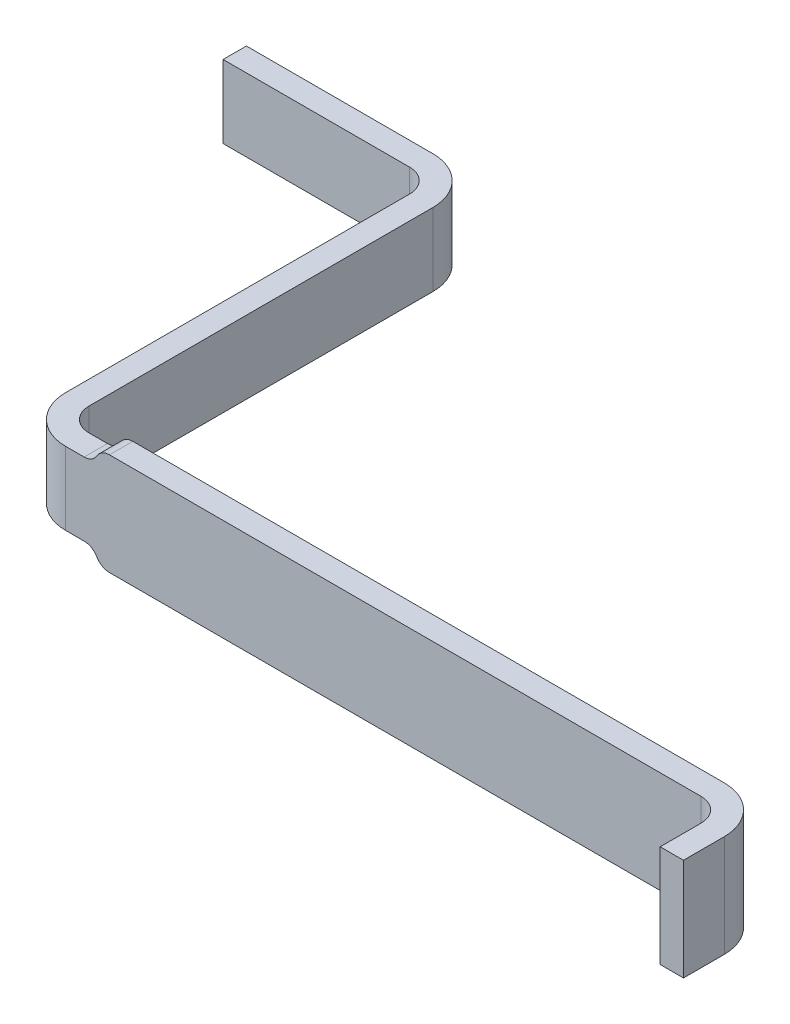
ISO-10303-21;
HEADER;
FILE_DESCRIPTION(('STEP AP214'),'2;1');
FILE_NAME('part.step','',(''),(''),'','','');
FILE_SCHEMA(('AUTOMOTIVE_DESIGN { 1 0 10303 214 1 1 1 1 }'));
ENDSEC;
DATA;
#1=APPLICATION_CONTEXT('core data for automotive mechanical design processes');
#2=APPLICATION_PROTOCOL_DEFINITION('international standard','automotive_design',2000,#1);
#3=PRODUCT_CONTEXT('',#1,'mechanical');
#4=PRODUCT('Part','Part','',(#3));
#5=PRODUCT_RELATED_PRODUCT_CATEGORY('part','',(#4));
#6=PRODUCT_DEFINITION_FORMATION('','',#4);
#7=PRODUCT_DEFINITION_CONTEXT('part definition',#1,'design');
#8=PRODUCT_DEFINITION('design','',#6,#7);
#9=PRODUCT_DEFINITION_SHAPE('','',#8);
#10=(LENGTH_UNIT() NAMED_UNIT(*) SI_UNIT(.MILLI.,.METRE.));
#11=(NAMED_UNIT(*) PLANE_ANGLE_UNIT() SI_UNIT($,.RADIAN.));
#12=(NAMED_UNIT(*) SI_UNIT($,.STERADIAN.) SOLID_ANGLE_UNIT());
#13=UNCERTAINTY_MEASURE_WITH_UNIT(LENGTH_MEASURE(1.E-05),#10,'distance_accuracy_value','');
#14=(GEOMETRIC_REPRESENTATION_CONTEXT(3) GLOBAL_UNCERTAINTY_ASSIGNED_CONTEXT((#13)) GLOBAL_UNIT_ASSIGNED_CONTEXT((#10,
#11,#12)) REPRESENTATION_CONTEXT('',''));
#15=CARTESIAN_POINT('',(0.,0.,0.));
#16=DIRECTION('',(0.,0.,1.));
#17=DIRECTION('',(1.,0.,0.));
#18=AXIS2_PLACEMENT_3D('',#15,#16,#17);
#19=CARTESIAN_POINT('',(1.31672563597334,0.,-0.0499999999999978));
#20=DIRECTION('',(0.,0.,-1.));
#21=DIRECTION('',(-1.,0.,0.));
#22=AXIS2_PLACEMENT_3D('',#19,#20,#21);
#23=PLANE('',#22);
#24=DIRECTION('',(0.,1.,0.));
#25=VECTOR('',#24,1.);
#26=CARTESIAN_POINT('',(-1.92,-0.175,-0.0500000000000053));
#27=LINE('',#26,#25);
#28=CARTESIAN_POINT('',(-1.92,-0.124999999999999,-0.0500000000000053));
#29=VERTEX_POINT('',#28);
#30=CARTESIAN_POINT('',(-1.92,0.125,-0.0500000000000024));
#31=VERTEX_POINT('',#30);
#32=EDGE_CURVE('E271',#29,#31,#27,.T.);
#33=ORIENTED_EDGE('',*,*,#32,.F.);
#34=DIRECTION('',(-1.,0.,0.));
#35=VECTOR('',#34,1.);
#36=CARTESIAN_POINT('',(-1.92,-0.124999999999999,-0.0500000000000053));
#37=LINE('',#36,#35);
#38=CARTESIAN_POINT('',(-1.28,-0.124999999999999,-0.0500000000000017));
#39=VERTEX_POINT('',#38);
#40=EDGE_CURVE('E127',#29,#39,#37,.F.);
#41=ORIENTED_EDGE('',*,*,#40,.T.);
#42=DIRECTION('',(0.,1.,0.));
#43=VECTOR('',#42,1.);
#44=CARTESIAN_POINT('',(-1.28,0.,-0.049999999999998));
#45=LINE('',#44,#43);
#46=CARTESIAN_POINT('',(-1.28,0.125,-0.0499999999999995));
#47=VERTEX_POINT('',#46);
#48=EDGE_CURVE('E263',#39,#47,#45,.T.);
#49=ORIENTED_EDGE('',*,*,#48,.T.);
#50=DIRECTION('',(1.,0.,0.));
#51=VECTOR('',#50,1.);
#52=CARTESIAN_POINT('',(0.290123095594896,0.124999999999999,-0.0500000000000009));
#53=LINE('',#52,#51);
#54=EDGE_CURVE('E261',#47,#31,#53,.F.);
#55=ORIENTED_EDGE('',*,*,#54,.T.);
#56=EDGE_LOOP('',(#33,#41,#49,#55));
#57=FACE_BOUND('',#56,.T.);
#58=ADVANCED_FACE('F16',(#57),#23,.F.);
#59=CARTESIAN_POINT('',(-1.92,-0.175,-0.0500000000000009));
#60=DIRECTION('',(-1.,0.,0.));
#61=DIRECTION('',(0.,0.,1.));
#62=AXIS2_PLACEMENT_3D('',#59,#60,#61);
#63=PLANE('',#62);
#64=DIRECTION('',(0.,0.,1.));
#65=VECTOR('',#64,1.);
#66=CARTESIAN_POINT('',(-1.92,-0.124999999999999,-0.0500000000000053));
#67=LINE('',#66,#65);
#68=CARTESIAN_POINT('',(-1.92,-0.124999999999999,-0.130000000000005));
#69=VERTEX_POINT('',#68);
#70=EDGE_CURVE('E133',#69,#29,#67,.T.);
#71=ORIENTED_EDGE('',*,*,#70,.T.);
#72=ORIENTED_EDGE('',*,*,#32,.T.);
#73=DIRECTION('',(0.,0.,1.));
#74=VECTOR('',#73,1.);
#75=CARTESIAN_POINT('',(-1.92,0.125,-0.05));
#76=LINE('',#75,#74);
#77=CARTESIAN_POINT('',(-1.92,0.125,-0.130000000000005));
#78=VERTEX_POINT('',#77);
#79=EDGE_CURVE('E256',#31,#78,#76,.F.);
#80=ORIENTED_EDGE('',*,*,#79,.T.);
#81=DIRECTION('',(0.,1.,0.));
#82=VECTOR('',#81,1.);
#83=CARTESIAN_POINT('',(-1.92,0.,-0.130000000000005));
#84=LINE('',#83,#82);
#85=EDGE_CURVE('E240',#69,#78,#84,.T.);
#86=ORIENTED_EDGE('',*,*,#85,.F.);
#87=EDGE_LOOP('',(#71,#72,#80,#86));
#88=FACE_BOUND('',#87,.T.);
#89=ADVANCED_FACE('F433',(#88),#63,.T.);
#90=CARTESIAN_POINT('',(-1.28,0.,0.0299999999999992));
#91=DIRECTION('',(0.,1.,0.));
#92=DIRECTION('',(0.,0.,1.));
#93=AXIS2_PLACEMENT_3D('',#90,#91,#92);
#94=CYLINDRICAL_SURFACE('',#93,0.0799999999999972);
#95=ORIENTED_EDGE('',*,*,#48,.F.);
#96=CARTESIAN_POINT('',(-1.28,-0.124999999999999,0.0299999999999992));
#97=DIRECTION('',(0.,1.,0.));
#98=DIRECTION('',(0.,0.,1.));
#99=AXIS2_PLACEMENT_3D('',#96,#97,#98);
#100=CIRCLE('',#99,0.0799999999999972);
#101=CARTESIAN_POINT('',(-1.2,-0.124999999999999,0.0299999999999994));
#102=VERTEX_POINT('',#101);
#103=EDGE_CURVE('E19',#39,#102,#100,.F.);
#104=ORIENTED_EDGE('',*,*,#103,.T.);
#105=DIRECTION('',(0.,1.,0.));
#106=VECTOR('',#105,1.);
#107=CARTESIAN_POINT('',(-1.2,0.,0.0299999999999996));
#108=LINE('',#107,#106);
#109=CARTESIAN_POINT('',(-1.2,0.125,0.0299999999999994));
#110=VERTEX_POINT('',#109);
#111=EDGE_CURVE('E229',#102,#110,#108,.T.);
#112=ORIENTED_EDGE('',*,*,#111,.T.);
#113=CARTESIAN_POINT('',(-1.28,0.125,0.0299999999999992));
#114=DIRECTION('',(0.,1.,0.));
#115=DIRECTION('',(0.,0.,1.));
#116=AXIS2_PLACEMENT_3D('',#113,#114,#115);
#117=CIRCLE('',#116,0.0799999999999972);
#118=EDGE_CURVE('E226',#110,#47,#117,.T.);
#119=ORIENTED_EDGE('',*,*,#118,.T.);
#120=EDGE_LOOP('',(#95,#104,#112,#119));
#121=FACE_BOUND('',#120,.T.);
#122=ADVANCED_FACE('F609',(#121),#94,.F.);
#123=CARTESIAN_POINT('',(1.22000000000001,0.,0.196637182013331));
#124=DIRECTION('',(1.,0.,0.));
#125=DIRECTION('',(0.,0.,-1.));
#126=AXIS2_PLACEMENT_3D('',#123,#124,#125);
#127=PLANE('',#126);
#128=DIRECTION('',(0.,0.,-1.));
#129=VECTOR('',#128,1.);
#130=CARTESIAN_POINT('',(1.22,-0.175,1.59));
#131=LINE('',#130,#129);
#132=CARTESIAN_POINT('',(1.22,-0.175,1.59));
#133=VERTEX_POINT('',#132);
#134=CARTESIAN_POINT('',(1.22,-0.175,1.45));
#135=VERTEX_POINT('',#134);
#136=EDGE_CURVE('E349',#133,#135,#131,.T.);
#137=ORIENTED_EDGE('',*,*,#136,.F.);
#138=DIRECTION('',(0.,1.,0.));
#139=VECTOR('',#138,1.);
#140=CARTESIAN_POINT('',(1.22,0.175,1.59));
#141=LINE('',#140,#139);
#142=CARTESIAN_POINT('',(1.22,0.175,1.59));
#143=VERTEX_POINT('',#142);
#144=EDGE_CURVE('E228',#143,#133,#141,.F.);
#145=ORIENTED_EDGE('',*,*,#144,.F.);
#146=DIRECTION('',(0.,0.,1.));
#147=VECTOR('',#146,1.);
#148=CARTESIAN_POINT('',(1.22,0.175,1.28663718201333));
#149=LINE('',#148,#147);
#150=CARTESIAN_POINT('',(1.22,0.175,1.45));
#151=VERTEX_POINT('',#150);
#152=EDGE_CURVE('E234',#151,#143,#149,.T.);
#153=ORIENTED_EDGE('',*,*,#152,.F.);
#154=DIRECTION('',(0.,-1.,0.));
#155=VECTOR('',#154,1.);
#156=CARTESIAN_POINT('',(1.22,0.,1.45));
#157=LINE('',#156,#155);
#158=EDGE_CURVE('E225',#151,#135,#157,.T.);
#159=ORIENTED_EDGE('',*,*,#158,.T.);
#160=EDGE_LOOP('',(#137,#145,#153,#159));
#161=FACE_BOUND('',#160,.T.);
#162=ADVANCED_FACE('F403',(#161),#127,.F.);
#163=CARTESIAN_POINT('',(1.31672563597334,0.,-0.129999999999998));
#164=DIRECTION('',(0.,0.,-1.));
#165=DIRECTION('',(-1.,0.,0.));
#166=AXIS2_PLACEMENT_3D('',#163,#164,#165);
#167=PLANE('',#166);
#168=DIRECTION('',(-1.,0.,0.));
#169=VECTOR('',#168,1.);
#170=CARTESIAN_POINT('',(1.31672563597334,-0.124999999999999,-0.129999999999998));
#171=LINE('',#170,#169);
#172=CARTESIAN_POINT('',(-1.28,-0.124999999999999,-0.130000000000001));
#173=VERTEX_POINT('',#172);
#174=EDGE_CURVE('E248',#173,#69,#171,.T.);
#175=ORIENTED_EDGE('',*,*,#174,.T.);
#176=ORIENTED_EDGE('',*,*,#85,.T.);
#177=DIRECTION('',(-1.,0.,0.));
#178=VECTOR('',#177,1.);
#179=CARTESIAN_POINT('',(1.31672563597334,0.125,-0.129999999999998));
#180=LINE('',#179,#178);
#181=CARTESIAN_POINT('',(-1.28,0.125,-0.130000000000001));
#182=VERTEX_POINT('',#181);
#183=EDGE_CURVE('E251',#78,#182,#180,.F.);
#184=ORIENTED_EDGE('',*,*,#183,.T.);
#185=DIRECTION('',(0.,1.,0.));
#186=VECTOR('',#185,1.);
#187=CARTESIAN_POINT('',(-1.28,0.,-0.129999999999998));
#188=LINE('',#187,#186);
#189=EDGE_CURVE('E222',#173,#182,#188,.T.);
#190=ORIENTED_EDGE('',*,*,#189,.F.);
#191=EDGE_LOOP('',(#175,#176,#184,#190));
#192=FACE_BOUND('',#191,.T.);
#193=ADVANCED_FACE('F436',(#192),#167,.T.);
#194=CARTESIAN_POINT('',(-1.20000000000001,0.,2.46336281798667));
#195=DIRECTION('',(1.,0.,0.));
#196=DIRECTION('',(0.,0.,-1.));
#197=AXIS2_PLACEMENT_3D('',#194,#195,#196);
#198=PLANE('',#197);
#199=ORIENTED_EDGE('',*,*,#111,.F.);
#200=DIRECTION('',(0.,0.,1.));
#201=VECTOR('',#200,1.);
#202=CARTESIAN_POINT('',(-1.2,-0.124999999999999,-0.77336281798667));
#203=LINE('',#202,#201);
#204=CARTESIAN_POINT('',(-1.2,-0.124999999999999,1.21));
#205=VERTEX_POINT('',#204);
#206=EDGE_CURVE('E247',#102,#205,#203,.T.);
#207=ORIENTED_EDGE('',*,*,#206,.T.);
#208=DIRECTION('',(0.,-1.,0.));
#209=VECTOR('',#208,1.);
#210=CARTESIAN_POINT('',(-1.2,0.,1.21));
#211=LINE('',#210,#209);
#212=CARTESIAN_POINT('',(-1.2,0.124999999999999,1.21));
#213=VERTEX_POINT('',#212);
#214=EDGE_CURVE('E343',#213,#205,#211,.T.);
#215=ORIENTED_EDGE('',*,*,#214,.F.);
#216=DIRECTION('',(0.,0.,-1.));
#217=VECTOR('',#216,1.);
#218=CARTESIAN_POINT('',(-1.2,0.124999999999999,1.43676027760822));
#219=LINE('',#218,#217);
#220=EDGE_CURVE('E331',#213,#110,#219,.T.);
#221=ORIENTED_EDGE('',*,*,#220,.T.);
#222=EDGE_LOOP('',(#199,#207,#215,#221));
#223=FACE_BOUND('',#222,.T.);
#224=ADVANCED_FACE('F427',(#223),#198,.F.);
#225=CARTESIAN_POINT('',(1.22,0.175,1.59));
#226=DIRECTION('',(0.,0.,1.));
#227=DIRECTION('',(1.,0.,0.));
#228=AXIS2_PLACEMENT_3D('',#225,#226,#227);
#229=PLANE('',#228);
#230=DIRECTION('',(0.,1.,0.));
#231=VECTOR('',#230,1.);
#232=CARTESIAN_POINT('',(1.3,0.,1.59));
#233=LINE('',#232,#231);
#234=CARTESIAN_POINT('',(1.3,0.175,1.59));
#235=VERTEX_POINT('',#234);
#236=CARTESIAN_POINT('',(1.3,-0.175,1.59));
#237=VERTEX_POINT('',#236);
#238=EDGE_CURVE('E330',#235,#237,#233,.F.);
#239=ORIENTED_EDGE('',*,*,#238,.F.);
#240=DIRECTION('',(1.,0.,0.));
#241=VECTOR('',#240,1.);
#242=CARTESIAN_POINT('',(1.22,0.175,1.59));
#243=LINE('',#242,#241);
#244=EDGE_CURVE('E357',#143,#235,#243,.T.);
#245=ORIENTED_EDGE('',*,*,#244,.F.);
#246=ORIENTED_EDGE('',*,*,#144,.T.);
#247=DIRECTION('',(1.,0.,0.));
#248=VECTOR('',#247,1.);
#249=CARTESIAN_POINT('',(1.22,-0.175,1.59));
#250=LINE('',#249,#248);
#251=EDGE_CURVE('E352',#237,#133,#250,.F.);
#252=ORIENTED_EDGE('',*,*,#251,.F.);
#253=EDGE_LOOP('',(#239,#245,#246,#252));
#254=FACE_BOUND('',#253,.T.);
#255=ADVANCED_FACE('F376',(#254),#229,.T.);
#256=CARTESIAN_POINT('',(1.14,0.,1.45));
#257=DIRECTION('',(0.,-1.,0.));
#258=DIRECTION('',(0.,0.,-1.));
#259=AXIS2_PLACEMENT_3D('',#256,#257,#258);
#260=CYLINDRICAL_SURFACE('',#259,0.0800000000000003);
#261=CARTESIAN_POINT('',(1.14,0.175,1.45));
#262=DIRECTION('',(0.,-1.,0.));
#263=DIRECTION('',(0.,0.,-1.));
#264=AXIS2_PLACEMENT_3D('',#261,#262,#263);
#265=CIRCLE('',#264,0.0800000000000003);
#266=CARTESIAN_POINT('',(1.14,0.175,1.37));
#267=VERTEX_POINT('',#266);
#268=EDGE_CURVE('E217',#267,#151,#265,.T.);
#269=ORIENTED_EDGE('',*,*,#268,.F.);
#270=DIRECTION('',(0.,1.,0.));
#271=VECTOR('',#270,1.);
#272=CARTESIAN_POINT('',(1.14,0.,1.37));
#273=LINE('',#272,#271);
#274=CARTESIAN_POINT('',(1.14,-0.175,1.37));
#275=VERTEX_POINT('',#274);
#276=EDGE_CURVE('E213',#267,#275,#273,.F.);
#277=ORIENTED_EDGE('',*,*,#276,.T.);
#278=CARTESIAN_POINT('',(1.14,-0.175,1.45));
#279=DIRECTION('',(0.,-1.,0.));
#280=DIRECTION('',(0.,0.,-1.));
#281=AXIS2_PLACEMENT_3D('',#278,#279,#280);
#282=CIRCLE('',#281,0.0800000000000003);
#283=EDGE_CURVE('E214',#135,#275,#282,.F.);
#284=ORIENTED_EDGE('',*,*,#283,.F.);
#285=ORIENTED_EDGE('',*,*,#158,.F.);
#286=EDGE_LOOP('',(#269,#277,#284,#285));
#287=FACE_BOUND('',#286,.T.);
#288=ADVANCED_FACE('F399',(#287),#260,.F.);
#289=CARTESIAN_POINT('',(-1.28,0.,0.0299999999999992));
#290=DIRECTION('',(0.,1.,0.));
#291=DIRECTION('',(0.,0.,1.));
#292=AXIS2_PLACEMENT_3D('',#289,#290,#291);
#293=CYLINDRICAL_SURFACE('',#292,0.159999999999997);
#294=CARTESIAN_POINT('',(-1.28,-0.124999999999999,0.0299999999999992));
#295=DIRECTION('',(0.,1.,0.));
#296=DIRECTION('',(0.,0.,1.));
#297=AXIS2_PLACEMENT_3D('',#294,#295,#296);
#298=CIRCLE('',#297,0.159999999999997);
#299=CARTESIAN_POINT('',(-1.12,-0.124999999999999,0.0299999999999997));
#300=VERTEX_POINT('',#299);
#301=EDGE_CURVE('E168',#300,#173,#298,.T.);
#302=ORIENTED_EDGE('',*,*,#301,.T.);
#303=ORIENTED_EDGE('',*,*,#189,.T.);
#304=CARTESIAN_POINT('',(-1.28,0.125,0.0299999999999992));
#305=DIRECTION('',(0.,1.,0.));
#306=DIRECTION('',(0.,0.,1.));
#307=AXIS2_PLACEMENT_3D('',#304,#305,#306);
#308=CIRCLE('',#307,0.159999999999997);
#309=CARTESIAN_POINT('',(-1.12,0.125,0.0299999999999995));
#310=VERTEX_POINT('',#309);
#311=EDGE_CURVE('E223',#182,#310,#308,.F.);
#312=ORIENTED_EDGE('',*,*,#311,.T.);
#313=DIRECTION('',(0.,1.,0.));
#314=VECTOR('',#313,1.);
#315=CARTESIAN_POINT('',(-1.11999999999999,0.,0.0299999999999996));
#316=LINE('',#315,#314);
#317=EDGE_CURVE('E170',#300,#310,#316,.T.);
#318=ORIENTED_EDGE('',*,*,#317,.F.);
#319=EDGE_LOOP('',(#302,#303,#312,#318));
#320=FACE_BOUND('',#319,.T.);
#321=ADVANCED_FACE('F438',(#320),#293,.T.);
#322=CARTESIAN_POINT('',(-1.04,0.,1.21));
#323=DIRECTION('',(0.,-1.,0.));
#324=DIRECTION('',(0.,0.,-1.));
#325=AXIS2_PLACEMENT_3D('',#322,#323,#324);
#326=CYLINDRICAL_SURFACE('',#325,0.16);
#327=CARTESIAN_POINT('',(-1.04,-0.124999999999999,1.21));
#328=DIRECTION('',(0.,-1.,0.));
#329=DIRECTION('',(0.,0.,-1.));
#330=AXIS2_PLACEMENT_3D('',#327,#328,#329);
#331=CIRCLE('',#330,0.16);
#332=CARTESIAN_POINT('',(-1.04,-0.124999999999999,1.37));
#333=VERTEX_POINT('',#332);
#334=EDGE_CURVE('E205',#205,#333,#331,.F.);
#335=ORIENTED_EDGE('',*,*,#334,.T.);
#336=DIRECTION('',(0.,1.,0.));
#337=VECTOR('',#336,1.);
#338=CARTESIAN_POINT('',(-1.04,0.,1.37));
#339=LINE('',#338,#337);
#340=CARTESIAN_POINT('',(-1.04,0.124999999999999,1.37));
#341=VERTEX_POINT('',#340);
#342=EDGE_CURVE('E319',#333,#341,#339,.T.);
#343=ORIENTED_EDGE('',*,*,#342,.T.);
#344=CARTESIAN_POINT('',(-1.04,0.124999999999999,1.21));
#345=DIRECTION('',(0.,-1.,0.));
#346=DIRECTION('',(0.,0.,-1.));
#347=AXIS2_PLACEMENT_3D('',#344,#345,#346);
#348=CIRCLE('',#347,0.16);
#349=EDGE_CURVE('E202',#341,#213,#348,.T.);
#350=ORIENTED_EDGE('',*,*,#349,.T.);
#351=ORIENTED_EDGE('',*,*,#214,.T.);
#352=EDGE_LOOP('',(#335,#343,#350,#351));
#353=FACE_BOUND('',#352,.T.);
#354=ADVANCED_FACE('F422',(#353),#326,.T.);
#355=CARTESIAN_POINT('',(1.30000000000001,0.,0.196637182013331));
#356=DIRECTION('',(1.,0.,0.));
#357=DIRECTION('',(0.,0.,-1.));
#358=AXIS2_PLACEMENT_3D('',#355,#356,#357);
#359=PLANE('',#358);
#360=ORIENTED_EDGE('',*,*,#238,.T.);
#361=DIRECTION('',(0.,0.,-1.));
#362=VECTOR('',#361,1.);
#363=CARTESIAN_POINT('',(1.30000000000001,-0.175,0.196637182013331));
#364=LINE('',#363,#362);
#365=CARTESIAN_POINT('',(1.3,-0.175,1.45));
#366=VERTEX_POINT('',#365);
#367=EDGE_CURVE('E220',#237,#366,#364,.T.);
#368=ORIENTED_EDGE('',*,*,#367,.T.);
#369=DIRECTION('',(0.,-1.,0.));
#370=VECTOR('',#369,1.);
#371=CARTESIAN_POINT('',(1.3,0.,1.45));
#372=LINE('',#371,#370);
#373=CARTESIAN_POINT('',(1.3,0.175,1.45));
#374=VERTEX_POINT('',#373);
#375=EDGE_CURVE('E193',#374,#366,#372,.T.);
#376=ORIENTED_EDGE('',*,*,#375,.F.);
#377=DIRECTION('',(0.,0.,-1.));
#378=VECTOR('',#377,1.);
#379=CARTESIAN_POINT('',(1.30000000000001,0.175,0.196637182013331));
#380=LINE('',#379,#378);
#381=EDGE_CURVE('E327',#374,#235,#380,.F.);
#382=ORIENTED_EDGE('',*,*,#381,.T.);
#383=EDGE_LOOP('',(#360,#368,#376,#382));
#384=FACE_BOUND('',#383,.T.);
#385=ADVANCED_FACE('F379',(#384),#359,.T.);
#386=CARTESIAN_POINT('',(0.05,0.,1.37));
#387=DIRECTION('',(0.,0.,-1.));
#388=DIRECTION('',(-1.,0.,0.));
#389=AXIS2_PLACEMENT_3D('',#386,#387,#388);
#390=PLANE('',#389);
#391=ORIENTED_EDGE('',*,*,#342,.F.);
#392=DIRECTION('',(-1.,0.,0.));
#393=VECTOR('',#392,1.);
#394=CARTESIAN_POINT('',(0.05,-0.124999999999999,1.37));
#395=LINE('',#394,#393);
#396=CARTESIAN_POINT('',(-0.976602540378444,-0.124999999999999,1.37));
#397=VERTEX_POINT('',#396);
#398=EDGE_CURVE('E210',#397,#333,#395,.T.);
#399=ORIENTED_EDGE('',*,*,#398,.F.);
#400=CARTESIAN_POINT('',(-0.976602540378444,-0.174999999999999,1.37));
#401=DIRECTION('',(0.,0.,-1.));
#402=DIRECTION('',(-1.,0.,0.));
#403=AXIS2_PLACEMENT_3D('',#400,#401,#402);
#404=CIRCLE('',#403,0.0500000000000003);
#405=CARTESIAN_POINT('',(-0.933301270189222,-0.149999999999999,1.37));
#406=VERTEX_POINT('',#405);
#407=EDGE_CURVE('E208',#406,#397,#404,.F.);
#408=ORIENTED_EDGE('',*,*,#407,.F.);
#409=CARTESIAN_POINT('',(-0.89,-0.125,1.37));
#410=DIRECTION('',(0.,0.,-1.));
#411=DIRECTION('',(-1.,0.,0.));
#412=AXIS2_PLACEMENT_3D('',#409,#410,#411);
#413=CIRCLE('',#412,0.0499999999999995);
#414=CARTESIAN_POINT('',(-0.89,-0.175,1.37));
#415=VERTEX_POINT('',#414);
#416=EDGE_CURVE('E211',#415,#406,#413,.T.);
#417=ORIENTED_EDGE('',*,*,#416,.F.);
#418=DIRECTION('',(1.,0.,0.));
#419=VECTOR('',#418,1.);
#420=CARTESIAN_POINT('',(1.3,-0.175,1.37));
#421=LINE('',#420,#419);
#422=EDGE_CURVE('E190',#275,#415,#421,.F.);
#423=ORIENTED_EDGE('',*,*,#422,.F.);
#424=ORIENTED_EDGE('',*,*,#276,.F.);
#425=DIRECTION('',(1.,0.,0.));
#426=VECTOR('',#425,1.);
#427=CARTESIAN_POINT('',(-1.2,0.175,1.37));
#428=LINE('',#427,#426);
#429=CARTESIAN_POINT('',(-0.89,0.175,1.37));
#430=VERTEX_POINT('',#429);
#431=EDGE_CURVE('E315',#430,#267,#428,.T.);
#432=ORIENTED_EDGE('',*,*,#431,.F.);
#433=CARTESIAN_POINT('',(-0.89,0.125,1.37));
#434=DIRECTION('',(0.,0.,-1.));
#435=DIRECTION('',(-1.,0.,0.));
#436=AXIS2_PLACEMENT_3D('',#433,#434,#435);
#437=CIRCLE('',#436,0.05);
#438=CARTESIAN_POINT('',(-0.933301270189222,0.15,1.37));
#439=VERTEX_POINT('',#438);
#440=EDGE_CURVE('E194',#439,#430,#437,.T.);
#441=ORIENTED_EDGE('',*,*,#440,.F.);
#442=CARTESIAN_POINT('',(-0.976602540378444,0.174999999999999,1.37));
#443=DIRECTION('',(0.,0.,-1.));
#444=DIRECTION('',(-1.,0.,0.));
#445=AXIS2_PLACEMENT_3D('',#442,#443,#444);
#446=CIRCLE('',#445,0.0499999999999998);
#447=CARTESIAN_POINT('',(-0.976602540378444,0.124999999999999,1.37));
#448=VERTEX_POINT('',#447);
#449=EDGE_CURVE('E198',#439,#448,#446,.T.);
#450=ORIENTED_EDGE('',*,*,#449,.T.);
#451=DIRECTION('',(1.,0.,0.));
#452=VECTOR('',#451,1.);
#453=CARTESIAN_POINT('',(-0.976602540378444,0.124999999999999,1.37));
#454=LINE('',#453,#452);
#455=EDGE_CURVE('E201',#448,#341,#454,.F.);
#456=ORIENTED_EDGE('',*,*,#455,.T.);
#457=EDGE_LOOP('',(#391,#399,#408,#417,#423,#424,#432,#441,#450,#456));
#458=FACE_BOUND('',#457,.T.);
#459=ADVANCED_FACE('F395',(#458),#390,.F.);
#460=CARTESIAN_POINT('',(-1.12,0.,2.46336281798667));
#461=DIRECTION('',(1.,0.,0.));
#462=DIRECTION('',(0.,0.,-1.));
#463=AXIS2_PLACEMENT_3D('',#460,#461,#462);
#464=PLANE('',#463);
#465=DIRECTION('',(0.,0.,-1.));
#466=VECTOR('',#465,1.);
#467=CARTESIAN_POINT('',(-1.12,-0.124999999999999,2.46336281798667));
#468=LINE('',#467,#466);
#469=CARTESIAN_POINT('',(-1.12,-0.124999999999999,1.21));
#470=VERTEX_POINT('',#469);
#471=EDGE_CURVE('E165',#470,#300,#468,.T.);
#472=ORIENTED_EDGE('',*,*,#471,.T.);
#473=ORIENTED_EDGE('',*,*,#317,.T.);
#474=DIRECTION('',(0.,0.,-1.));
#475=VECTOR('',#474,1.);
#476=CARTESIAN_POINT('',(-1.12,0.125,2.46336281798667));
#477=LINE('',#476,#475);
#478=CARTESIAN_POINT('',(-1.12,0.124999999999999,1.21));
#479=VERTEX_POINT('',#478);
#480=EDGE_CURVE('E162',#310,#479,#477,.F.);
#481=ORIENTED_EDGE('',*,*,#480,.T.);
#482=DIRECTION('',(0.,-1.,0.));
#483=VECTOR('',#482,1.);
#484=CARTESIAN_POINT('',(-1.12,0.,1.21));
#485=LINE('',#484,#483);
#486=EDGE_CURVE('E173',#479,#470,#485,.T.);
#487=ORIENTED_EDGE('',*,*,#486,.T.);
#488=EDGE_LOOP('',(#472,#473,#481,#487));
#489=FACE_BOUND('',#488,.T.);
#490=ADVANCED_FACE('F174',(#489),#464,.T.);
#491=CARTESIAN_POINT('',(-0.976602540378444,0.124999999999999,1.37));
#492=DIRECTION('',(0.,-1.,0.));
#493=DIRECTION('',(1.,0.,0.));
#494=AXIS2_PLACEMENT_3D('',#491,#492,#493);
#495=PLANE('',#494);
#496=ORIENTED_EDGE('',*,*,#455,.F.);
#497=DIRECTION('',(0.,0.,-1.));
#498=VECTOR('',#497,1.);
#499=CARTESIAN_POINT('',(-0.976602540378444,0.124999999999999,1.37));
#500=LINE('',#499,#498);
#501=CARTESIAN_POINT('',(-0.976602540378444,0.124999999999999,1.29));
#502=VERTEX_POINT('',#501);
#503=EDGE_CURVE('E200',#448,#502,#500,.T.);
#504=ORIENTED_EDGE('',*,*,#503,.T.);
#505=DIRECTION('',(-1.,0.,0.));
#506=VECTOR('',#505,1.);
#507=CARTESIAN_POINT('',(0.05,0.124999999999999,1.29));
#508=LINE('',#507,#506);
#509=CARTESIAN_POINT('',(-1.04,0.124999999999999,1.29));
#510=VERTEX_POINT('',#509);
#511=EDGE_CURVE('E183',#510,#502,#508,.F.);
#512=ORIENTED_EDGE('',*,*,#511,.F.);
#513=CARTESIAN_POINT('',(-1.04,0.124999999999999,1.21));
#514=DIRECTION('',(0.,-1.,0.));
#515=DIRECTION('',(0.,0.,-1.));
#516=AXIS2_PLACEMENT_3D('',#513,#514,#515);
#517=CIRCLE('',#516,0.0800000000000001);
#518=EDGE_CURVE('E181',#510,#479,#517,.T.);
#519=ORIENTED_EDGE('',*,*,#518,.T.);
#520=ORIENTED_EDGE('',*,*,#480,.F.);
#521=ORIENTED_EDGE('',*,*,#311,.F.);
#522=ORIENTED_EDGE('',*,*,#183,.F.);
#523=ORIENTED_EDGE('',*,*,#79,.F.);
#524=ORIENTED_EDGE('',*,*,#54,.F.);
#525=ORIENTED_EDGE('',*,*,#118,.F.);
#526=ORIENTED_EDGE('',*,*,#220,.F.);
#527=ORIENTED_EDGE('',*,*,#349,.F.);
#528=EDGE_LOOP('',(#496,#504,#512,#519,#520,#521,#522,#523,#524,#525,#526,#527));
#529=FACE_BOUND('',#528,.T.);
#530=ADVANCED_FACE('F429',(#529),#495,.F.);
#531=CARTESIAN_POINT('',(-0.976602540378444,0.174999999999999,1.37));
#532=DIRECTION('',(0.,0.,-1.));
#533=DIRECTION('',(-1.,0.,0.));
#534=AXIS2_PLACEMENT_3D('',#531,#532,#533);
#535=CYLINDRICAL_SURFACE('',#534,0.0499999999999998);
#536=ORIENTED_EDGE('',*,*,#503,.F.);
#537=ORIENTED_EDGE('',*,*,#449,.F.);
#538=DIRECTION('',(0.,0.,-1.));
#539=VECTOR('',#538,1.);
#540=CARTESIAN_POINT('',(-0.933301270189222,0.15,1.37));
#541=LINE('',#540,#539);
#542=CARTESIAN_POINT('',(-0.933301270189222,0.15,1.29));
#543=VERTEX_POINT('',#542);
#544=EDGE_CURVE('E197',#543,#439,#541,.F.);
#545=ORIENTED_EDGE('',*,*,#544,.F.);
#546=CARTESIAN_POINT('',(-0.976602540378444,0.174999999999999,1.29));
#547=DIRECTION('',(0.,0.,-1.));
#548=DIRECTION('',(-1.,0.,0.));
#549=AXIS2_PLACEMENT_3D('',#546,#547,#548);
#550=CIRCLE('',#549,0.0499999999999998);
#551=EDGE_CURVE('E295',#502,#543,#550,.F.);
#552=ORIENTED_EDGE('',*,*,#551,.F.);
#553=EDGE_LOOP('',(#536,#537,#545,#552));
#554=FACE_BOUND('',#553,.T.);
#555=ADVANCED_FACE('F441',(#554),#535,.F.);
#556=CARTESIAN_POINT('',(-0.89,0.125,1.37));
#557=DIRECTION('',(0.,0.,-1.));
#558=DIRECTION('',(-1.,0.,0.));
#559=AXIS2_PLACEMENT_3D('',#556,#557,#558);
#560=CYLINDRICAL_SURFACE('',#559,0.05);
#561=ORIENTED_EDGE('',*,*,#440,.T.);
#562=DIRECTION('',(0.,0.,1.));
#563=VECTOR('',#562,1.);
#564=CARTESIAN_POINT('',(-0.89,0.175,1.37));
#565=LINE('',#564,#563);
#566=CARTESIAN_POINT('',(-0.89,0.175,1.29));
#567=VERTEX_POINT('',#566);
#568=EDGE_CURVE('E196',#567,#430,#565,.T.);
#569=ORIENTED_EDGE('',*,*,#568,.F.);
#570=CARTESIAN_POINT('',(-0.89,0.125,1.29));
#571=DIRECTION('',(0.,0.,-1.));
#572=DIRECTION('',(-1.,0.,0.));
#573=AXIS2_PLACEMENT_3D('',#570,#571,#572);
#574=CIRCLE('',#573,0.05);
#575=EDGE_CURVE('E292',#543,#567,#574,.T.);
#576=ORIENTED_EDGE('',*,*,#575,.F.);
#577=ORIENTED_EDGE('',*,*,#544,.T.);
#578=EDGE_LOOP('',(#561,#569,#576,#577));
#579=FACE_BOUND('',#578,.T.);
#580=ADVANCED_FACE('F389',(#579),#560,.T.);
#581=CARTESIAN_POINT('',(-1.2,0.175,1.37));
#582=DIRECTION('',(0.,1.,0.));
#583=DIRECTION('',(0.,0.,1.));
#584=AXIS2_PLACEMENT_3D('',#581,#582,#583);
#585=PLANE('',#584);
#586=ORIENTED_EDGE('',*,*,#431,.T.);
#587=ORIENTED_EDGE('',*,*,#268,.T.);
#588=ORIENTED_EDGE('',*,*,#152,.T.);
#589=ORIENTED_EDGE('',*,*,#244,.T.);
#590=ORIENTED_EDGE('',*,*,#381,.F.);
#591=CARTESIAN_POINT('',(1.14,0.175,1.45));
#592=DIRECTION('',(0.,-1.,0.));
#593=DIRECTION('',(0.,0.,-1.));
#594=AXIS2_PLACEMENT_3D('',#591,#592,#593);
#595=CIRCLE('',#594,0.16);
#596=CARTESIAN_POINT('',(1.14,0.175,1.29));
#597=VERTEX_POINT('',#596);
#598=EDGE_CURVE('E187',#597,#374,#595,.T.);
#599=ORIENTED_EDGE('',*,*,#598,.F.);
#600=DIRECTION('',(-1.,0.,0.));
#601=VECTOR('',#600,1.);
#602=CARTESIAN_POINT('',(0.05,0.175,1.29));
#603=LINE('',#602,#601);
#604=EDGE_CURVE('E294',#567,#597,#603,.F.);
#605=ORIENTED_EDGE('',*,*,#604,.F.);
#606=ORIENTED_EDGE('',*,*,#568,.T.);
#607=EDGE_LOOP('',(#586,#587,#588,#589,#590,#599,#605,#606));
#608=FACE_BOUND('',#607,.T.);
#609=ADVANCED_FACE('F371',(#608),#585,.T.);
#610=CARTESIAN_POINT('',(1.14,0.,1.45));
#611=DIRECTION('',(0.,-1.,0.));
#612=DIRECTION('',(0.,0.,-1.));
#613=AXIS2_PLACEMENT_3D('',#610,#611,#612);
#614=CYLINDRICAL_SURFACE('',#613,0.16);
#615=DIRECTION('',(0.,1.,0.));
#616=VECTOR('',#615,1.);
#617=CARTESIAN_POINT('',(1.14,0.,1.29));
#618=LINE('',#617,#616);
#619=CARTESIAN_POINT('',(1.14,-0.175,1.29));
#620=VERTEX_POINT('',#619);
#621=EDGE_CURVE('E310',#597,#620,#618,.F.);
#622=ORIENTED_EDGE('',*,*,#621,.F.);
#623=ORIENTED_EDGE('',*,*,#598,.T.);
#624=ORIENTED_EDGE('',*,*,#375,.T.);
#625=CARTESIAN_POINT('',(1.14,-0.175,1.45));
#626=DIRECTION('',(0.,-1.,0.));
#627=DIRECTION('',(0.,0.,-1.));
#628=AXIS2_PLACEMENT_3D('',#625,#626,#627);
#629=CIRCLE('',#628,0.16);
#630=EDGE_CURVE('E191',#366,#620,#629,.F.);
#631=ORIENTED_EDGE('',*,*,#630,.T.);
#632=EDGE_LOOP('',(#622,#623,#624,#631));
#633=FACE_BOUND('',#632,.T.);
#634=ADVANCED_FACE('F383',(#633),#614,.T.);
#635=CARTESIAN_POINT('',(1.3,-0.175,1.37));
#636=DIRECTION('',(0.,-1.,0.));
#637=DIRECTION('',(0.,0.,-1.));
#638=AXIS2_PLACEMENT_3D('',#635,#636,#637);
#639=PLANE('',#638);
#640=DIRECTION('',(-1.,0.,0.));
#641=VECTOR('',#640,1.);
#642=CARTESIAN_POINT('',(0.05,-0.175,1.29));
#643=LINE('',#642,#641);
#644=CARTESIAN_POINT('',(-0.89,-0.175,1.29));
#645=VERTEX_POINT('',#644);
#646=EDGE_CURVE('E291',#620,#645,#643,.T.);
#647=ORIENTED_EDGE('',*,*,#646,.F.);
#648=ORIENTED_EDGE('',*,*,#630,.F.);
#649=ORIENTED_EDGE('',*,*,#367,.F.);
#650=ORIENTED_EDGE('',*,*,#251,.T.);
#651=ORIENTED_EDGE('',*,*,#136,.T.);
#652=ORIENTED_EDGE('',*,*,#283,.T.);
#653=ORIENTED_EDGE('',*,*,#422,.T.);
#654=DIRECTION('',(0.,0.,-1.));
#655=VECTOR('',#654,1.);
#656=CARTESIAN_POINT('',(-0.89,-0.175,1.37));
#657=LINE('',#656,#655);
#658=EDGE_CURVE('E307',#645,#415,#657,.F.);
#659=ORIENTED_EDGE('',*,*,#658,.F.);
#660=EDGE_LOOP('',(#647,#648,#649,#650,#651,#652,#653,#659));
#661=FACE_BOUND('',#660,.T.);
#662=ADVANCED_FACE('F407',(#661),#639,.T.);
#663=CARTESIAN_POINT('',(-0.89,-0.125,1.37));
#664=DIRECTION('',(0.,0.,-1.));
#665=DIRECTION('',(-1.,0.,0.));
#666=AXIS2_PLACEMENT_3D('',#663,#664,#665);
#667=CYLINDRICAL_SURFACE('',#666,0.0499999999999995);
#668=ORIENTED_EDGE('',*,*,#416,.T.);
#669=DIRECTION('',(0.,0.,-1.));
#670=VECTOR('',#669,1.);
#671=CARTESIAN_POINT('',(-0.933301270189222,-0.149999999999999,1.37));
#672=LINE('',#671,#670);
#673=CARTESIAN_POINT('',(-0.933301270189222,-0.149999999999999,1.29));
#674=VERTEX_POINT('',#673);
#675=EDGE_CURVE('E304',#406,#674,#672,.T.);
#676=ORIENTED_EDGE('',*,*,#675,.T.);
#677=CARTESIAN_POINT('',(-0.89,-0.125,1.29));
#678=DIRECTION('',(0.,0.,-1.));
#679=DIRECTION('',(-1.,0.,0.));
#680=AXIS2_PLACEMENT_3D('',#677,#678,#679);
#681=CIRCLE('',#680,0.0499999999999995);
#682=EDGE_CURVE('E288',#645,#674,#681,.T.);
#683=ORIENTED_EDGE('',*,*,#682,.F.);
#684=ORIENTED_EDGE('',*,*,#658,.T.);
#685=EDGE_LOOP('',(#668,#676,#683,#684));
#686=FACE_BOUND('',#685,.T.);
#687=ADVANCED_FACE('F463',(#686),#667,.T.);
#688=CARTESIAN_POINT('',(-0.976602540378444,-0.174999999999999,1.37));
#689=DIRECTION('',(0.,0.,-1.));
#690=DIRECTION('',(-1.,0.,0.));
#691=AXIS2_PLACEMENT_3D('',#688,#689,#690);
#692=CYLINDRICAL_SURFACE('',#691,0.0500000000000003);
#693=ORIENTED_EDGE('',*,*,#675,.F.);
#694=ORIENTED_EDGE('',*,*,#407,.T.);
#695=DIRECTION('',(0.,0.,1.));
#696=VECTOR('',#695,1.);
#697=CARTESIAN_POINT('',(-0.976602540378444,-0.124999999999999,1.37));
#698=LINE('',#697,#696);
#699=CARTESIAN_POINT('',(-0.976602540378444,-0.124999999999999,1.29));
#700=VERTEX_POINT('',#699);
#701=EDGE_CURVE('E177',#397,#700,#698,.F.);
#702=ORIENTED_EDGE('',*,*,#701,.T.);
#703=CARTESIAN_POINT('',(-0.976602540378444,-0.174999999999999,1.29));
#704=DIRECTION('',(0.,0.,-1.));
#705=DIRECTION('',(-1.,0.,0.));
#706=AXIS2_PLACEMENT_3D('',#703,#704,#705);
#707=CIRCLE('',#706,0.0500000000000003);
#708=EDGE_CURVE('E285',#674,#700,#707,.F.);
#709=ORIENTED_EDGE('',*,*,#708,.F.);
#710=EDGE_LOOP('',(#693,#694,#702,#709));
#711=FACE_BOUND('',#710,.T.);
#712=ADVANCED_FACE('F460',(#711),#692,.F.);
#713=CARTESIAN_POINT('',(-3.18672563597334,-0.124999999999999,1.37));
#714=DIRECTION('',(0.,1.,0.));
#715=DIRECTION('',(-1.,0.,0.));
#716=AXIS2_PLACEMENT_3D('',#713,#714,#715);
#717=PLANE('',#716);
#718=DIRECTION('',(-1.,0.,0.));
#719=VECTOR('',#718,1.);
#720=CARTESIAN_POINT('',(0.05,-0.124999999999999,1.29));
#721=LINE('',#720,#719);
#722=CARTESIAN_POINT('',(-1.04,-0.124999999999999,1.29));
#723=VERTEX_POINT('',#722);
#724=EDGE_CURVE('E25',#700,#723,#721,.T.);
#725=ORIENTED_EDGE('',*,*,#724,.F.);
#726=ORIENTED_EDGE('',*,*,#701,.F.);
#727=ORIENTED_EDGE('',*,*,#398,.T.);
#728=ORIENTED_EDGE('',*,*,#334,.F.);
#729=ORIENTED_EDGE('',*,*,#206,.F.);
#730=ORIENTED_EDGE('',*,*,#103,.F.);
#731=ORIENTED_EDGE('',*,*,#40,.F.);
#732=ORIENTED_EDGE('',*,*,#70,.F.);
#733=ORIENTED_EDGE('',*,*,#174,.F.);
#734=ORIENTED_EDGE('',*,*,#301,.F.);
#735=ORIENTED_EDGE('',*,*,#471,.F.);
#736=CARTESIAN_POINT('',(-1.04,-0.124999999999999,1.21));
#737=DIRECTION('',(0.,-1.,0.));
#738=DIRECTION('',(0.,0.,-1.));
#739=AXIS2_PLACEMENT_3D('',#736,#737,#738);
#740=CIRCLE('',#739,0.0800000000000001);
#741=EDGE_CURVE('E34',#470,#723,#740,.F.);
#742=ORIENTED_EDGE('',*,*,#741,.T.);
#743=EDGE_LOOP('',(#725,#726,#727,#728,#729,#730,#731,#732,#733,#734,#735,#742));
#744=FACE_BOUND('',#743,.T.);
#745=ADVANCED_FACE('F166',(#744),#717,.F.);
#746=CARTESIAN_POINT('',(-1.04,0.,1.21));
#747=DIRECTION('',(0.,-1.,0.));
#748=DIRECTION('',(0.,0.,-1.));
#749=AXIS2_PLACEMENT_3D('',#746,#747,#748);
#750=CYLINDRICAL_SURFACE('',#749,0.0800000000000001);
#751=DIRECTION('',(0.,1.,0.));
#752=VECTOR('',#751,1.);
#753=CARTESIAN_POINT('',(-1.04,0.,1.29));
#754=LINE('',#753,#752);
#755=EDGE_CURVE('E11',#723,#510,#754,.T.);
#756=ORIENTED_EDGE('',*,*,#755,.F.);
#757=ORIENTED_EDGE('',*,*,#741,.F.);
#758=ORIENTED_EDGE('',*,*,#486,.F.);
#759=ORIENTED_EDGE('',*,*,#518,.F.);
#760=EDGE_LOOP('',(#756,#757,#758,#759));
#761=FACE_BOUND('',#760,.T.);
#762=ADVANCED_FACE('F179',(#761),#750,.F.);
#763=CARTESIAN_POINT('',(0.05,0.,1.29));
#764=DIRECTION('',(0.,0.,-1.));
#765=DIRECTION('',(-1.,0.,0.));
#766=AXIS2_PLACEMENT_3D('',#763,#764,#765);
#767=PLANE('',#766);
#768=ORIENTED_EDGE('',*,*,#724,.T.);
#769=ORIENTED_EDGE('',*,*,#755,.T.);
#770=ORIENTED_EDGE('',*,*,#511,.T.);
#771=ORIENTED_EDGE('',*,*,#551,.T.);
#772=ORIENTED_EDGE('',*,*,#575,.T.);
#773=ORIENTED_EDGE('',*,*,#604,.T.);
#774=ORIENTED_EDGE('',*,*,#621,.T.);
#775=ORIENTED_EDGE('',*,*,#646,.T.);
#776=ORIENTED_EDGE('',*,*,#682,.T.);
#777=ORIENTED_EDGE('',*,*,#708,.T.);
#778=EDGE_LOOP('',(#768,#769,#770,#771,#772,#773,#774,#775,#776,#777));
#779=FACE_BOUND('',#778,.T.);
#780=ADVANCED_FACE('F387',(#779),#767,.T.);
#781=CLOSED_SHELL('',(#58,#89,#122,#162,#193,#224,#255,#288,#321,#354,#385,#459,#490,#530,#555,
#580,#609,#634,#662,#687,#712,#745,#762,#780));
#782=MANIFOLD_SOLID_BREP('B1',#781);
#783=ADVANCED_BREP_SHAPE_REPRESENTATION('',(#18,#782),#14);
#784=SHAPE_DEFINITION_REPRESENTATION(#9,#783);
ENDSEC;
END-ISO-10303-21;
